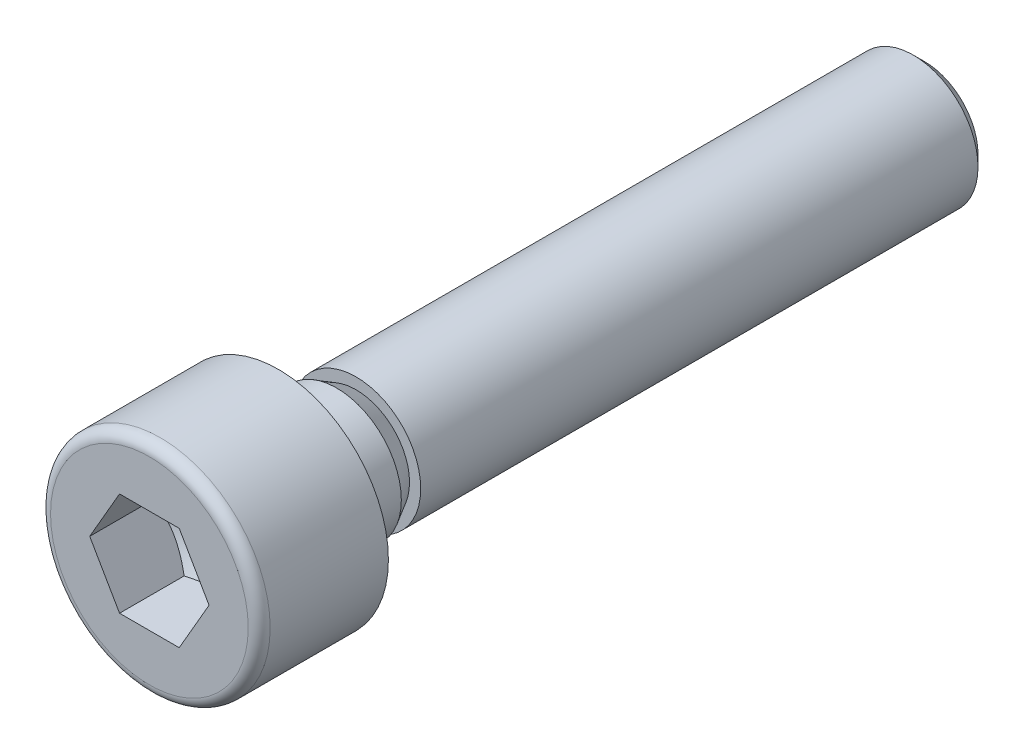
ISO-10303-21;
HEADER;
FILE_DESCRIPTION(('STEP AP214'),'2;1');
FILE_NAME('part.step','',(''),(''),'','','');
FILE_SCHEMA(('AUTOMOTIVE_DESIGN { 1 0 10303 214 1 1 1 1 }'));
ENDSEC;
DATA;
#1=APPLICATION_CONTEXT('core data for automotive mechanical design processes');
#2=APPLICATION_PROTOCOL_DEFINITION('international standard','automotive_design',2000,#1);
#3=PRODUCT_CONTEXT('',#1,'mechanical');
#4=PRODUCT('Part','Part','',(#3));
#5=PRODUCT_RELATED_PRODUCT_CATEGORY('part','',(#4));
#6=PRODUCT_DEFINITION_FORMATION('','',#4);
#7=PRODUCT_DEFINITION_CONTEXT('part definition',#1,'design');
#8=PRODUCT_DEFINITION('design','',#6,#7);
#9=PRODUCT_DEFINITION_SHAPE('','',#8);
#10=(LENGTH_UNIT() NAMED_UNIT(*) SI_UNIT(.MILLI.,.METRE.));
#11=(NAMED_UNIT(*) PLANE_ANGLE_UNIT() SI_UNIT($,.RADIAN.));
#12=(NAMED_UNIT(*) SI_UNIT($,.STERADIAN.) SOLID_ANGLE_UNIT());
#13=UNCERTAINTY_MEASURE_WITH_UNIT(LENGTH_MEASURE(1.E-05),#10,'distance_accuracy_value','');
#14=(GEOMETRIC_REPRESENTATION_CONTEXT(3) GLOBAL_UNCERTAINTY_ASSIGNED_CONTEXT((#13)) GLOBAL_UNIT_ASSIGNED_CONTEXT((#10,
#11,#12)) REPRESENTATION_CONTEXT('',''));
#15=CARTESIAN_POINT('',(0.,0.,0.));
#16=DIRECTION('',(0.,0.,1.));
#17=DIRECTION('',(1.,0.,0.));
#18=AXIS2_PLACEMENT_3D('',#15,#16,#17);
#19=CARTESIAN_POINT('',(0.,0.,5.));
#20=DIRECTION('',(0.,0.,1.));
#21=DIRECTION('',(1.,0.,0.));
#22=AXIS2_PLACEMENT_3D('',#19,#20,#21);
#23=PLANE('',#22);
#24=CARTESIAN_POINT('',(0.,0.,5.));
#25=DIRECTION('',(0.,0.,1.));
#26=DIRECTION('',(1.,0.,0.));
#27=AXIS2_PLACEMENT_3D('',#24,#25,#26);
#28=CIRCLE('',#27,3.825);
#29=CARTESIAN_POINT('',(3.825,0.,5.));
#30=VERTEX_POINT('',#29);
#31=EDGE_CURVE('E11',#30,#30,#28,.T.);
#32=ORIENTED_EDGE('',*,*,#31,.T.);
#33=EDGE_LOOP('',(#32));
#34=FACE_BOUND('',#33,.T.);
#35=DIRECTION('',(1.,0.,0.));
#36=VECTOR('',#35,1.);
#37=CARTESIAN_POINT('',(-1.1547,1.99999906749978,5.));
#38=LINE('',#37,#36);
#39=CARTESIAN_POINT('',(-1.1547,1.99999906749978,5.));
#40=VERTEX_POINT('',#39);
#41=CARTESIAN_POINT('',(1.1547,1.99999906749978,5.));
#42=VERTEX_POINT('',#41);
#43=EDGE_CURVE('E92',#40,#42,#38,.T.);
#44=ORIENTED_EDGE('',*,*,#43,.T.);
#45=DIRECTION('',(0.5,-0.866025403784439,0.));
#46=VECTOR('',#45,1.);
#47=CARTESIAN_POINT('',(1.1547,1.99999906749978,5.));
#48=LINE('',#47,#46);
#49=CARTESIAN_POINT('',(2.3094,0.,5.));
#50=VERTEX_POINT('',#49);
#51=EDGE_CURVE('E31',#42,#50,#48,.T.);
#52=ORIENTED_EDGE('',*,*,#51,.T.);
#53=DIRECTION('',(-0.5,-0.866025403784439,0.));
#54=VECTOR('',#53,1.);
#55=CARTESIAN_POINT('',(2.3094,0.,5.));
#56=LINE('',#55,#54);
#57=CARTESIAN_POINT('',(1.1547,-1.99999906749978,5.));
#58=VERTEX_POINT('',#57);
#59=EDGE_CURVE('E169',#50,#58,#56,.T.);
#60=ORIENTED_EDGE('',*,*,#59,.T.);
#61=DIRECTION('',(-1.,0.,0.));
#62=VECTOR('',#61,1.);
#63=CARTESIAN_POINT('',(1.1547,-1.99999906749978,5.));
#64=LINE('',#63,#62);
#65=CARTESIAN_POINT('',(-1.1547,-1.99999906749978,5.));
#66=VERTEX_POINT('',#65);
#67=EDGE_CURVE('E165',#58,#66,#64,.T.);
#68=ORIENTED_EDGE('',*,*,#67,.T.);
#69=DIRECTION('',(-0.5,0.866025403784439,0.));
#70=VECTOR('',#69,1.);
#71=CARTESIAN_POINT('',(-1.1547,-1.99999906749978,5.));
#72=LINE('',#71,#70);
#73=CARTESIAN_POINT('',(-2.3094,0.,5.));
#74=VERTEX_POINT('',#73);
#75=EDGE_CURVE('E160',#66,#74,#72,.T.);
#76=ORIENTED_EDGE('',*,*,#75,.T.);
#77=DIRECTION('',(0.5,0.866025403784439,0.));
#78=VECTOR('',#77,1.);
#79=CARTESIAN_POINT('',(-2.3094,0.,5.));
#80=LINE('',#79,#78);
#81=EDGE_CURVE('E96',#74,#40,#80,.T.);
#82=ORIENTED_EDGE('',*,*,#81,.T.);
#83=EDGE_LOOP('',(#44,#52,#60,#68,#76,#82));
#84=FACE_BOUND('',#83,.T.);
#85=ADVANCED_FACE('F17',(#34,#84),#23,.T.);
#86=CARTESIAN_POINT('',(0.,0.,4.575));
#87=DIRECTION('',(0.,0.,1.));
#88=DIRECTION('',(1.,0.,0.));
#89=AXIS2_PLACEMENT_3D('',#86,#87,#88);
#90=TOROIDAL_SURFACE('',#89,3.825,0.425);
#91=ORIENTED_EDGE('',*,*,#31,.F.);
#92=EDGE_LOOP('',(#91));
#93=FACE_BOUND('',#92,.T.);
#94=CARTESIAN_POINT('',(0.,0.,4.575));
#95=DIRECTION('',(0.,0.,1.));
#96=DIRECTION('',(1.,0.,0.));
#97=AXIS2_PLACEMENT_3D('',#94,#95,#96);
#98=CIRCLE('',#97,4.25);
#99=CARTESIAN_POINT('',(4.25,0.,4.575));
#100=VERTEX_POINT('',#99);
#101=EDGE_CURVE('E24',#100,#100,#98,.T.);
#102=ORIENTED_EDGE('',*,*,#101,.T.);
#103=EDGE_LOOP('',(#102));
#104=FACE_BOUND('',#103,.T.);
#105=ADVANCED_FACE('F133',(#93,#104),#90,.T.);
#106=CARTESIAN_POINT('',(0.,0.,5.));
#107=DIRECTION('',(0.,0.,1.));
#108=DIRECTION('',(1.,0.,0.));
#109=AXIS2_PLACEMENT_3D('',#106,#107,#108);
#110=CYLINDRICAL_SURFACE('',#109,4.25);
#111=CARTESIAN_POINT('',(0.,0.,0.));
#112=DIRECTION('',(0.,0.,1.));
#113=DIRECTION('',(1.,0.,0.));
#114=AXIS2_PLACEMENT_3D('',#111,#112,#113);
#115=CIRCLE('',#114,4.25);
#116=CARTESIAN_POINT('',(4.25,0.,0.));
#117=VERTEX_POINT('',#116);
#118=EDGE_CURVE('E128',#117,#117,#115,.T.);
#119=ORIENTED_EDGE('',*,*,#118,.T.);
#120=EDGE_LOOP('',(#119));
#121=FACE_BOUND('',#120,.T.);
#122=ORIENTED_EDGE('',*,*,#101,.F.);
#123=EDGE_LOOP('',(#122));
#124=FACE_BOUND('',#123,.T.);
#125=ADVANCED_FACE('F135',(#121,#124),#110,.T.);
#126=CARTESIAN_POINT('',(0.,4.25,0.));
#127=DIRECTION('',(0.,0.,-1.));
#128=DIRECTION('',(-1.,0.,0.));
#129=AXIS2_PLACEMENT_3D('',#126,#127,#128);
#130=PLANE('',#129);
#131=CARTESIAN_POINT('',(0.,0.,0.));
#132=DIRECTION('',(0.,0.,1.));
#133=DIRECTION('',(1.,0.,0.));
#134=AXIS2_PLACEMENT_3D('',#131,#132,#133);
#135=CIRCLE('',#134,2.75);
#136=CARTESIAN_POINT('',(2.75,0.,0.));
#137=VERTEX_POINT('',#136);
#138=EDGE_CURVE('E125',#137,#137,#135,.T.);
#139=ORIENTED_EDGE('',*,*,#138,.T.);
#140=EDGE_LOOP('',(#139));
#141=FACE_BOUND('',#140,.T.);
#142=ORIENTED_EDGE('',*,*,#118,.F.);
#143=EDGE_LOOP('',(#142));
#144=FACE_BOUND('',#143,.T.);
#145=ADVANCED_FACE('F137',(#141,#144),#130,.T.);
#146=CARTESIAN_POINT('',(0.,0.,-0.25));
#147=DIRECTION('',(0.,0.,1.));
#148=DIRECTION('',(1.,0.,0.));
#149=AXIS2_PLACEMENT_3D('',#146,#147,#148);
#150=TOROIDAL_SURFACE('',#149,2.75,0.25);
#151=CARTESIAN_POINT('',(0.,0.,-0.25));
#152=DIRECTION('',(0.,0.,1.));
#153=DIRECTION('',(1.,0.,0.));
#154=AXIS2_PLACEMENT_3D('',#151,#152,#153);
#155=CIRCLE('',#154,2.5);
#156=CARTESIAN_POINT('',(2.5,0.,-0.25));
#157=VERTEX_POINT('',#156);
#158=EDGE_CURVE('E122',#157,#157,#155,.T.);
#159=ORIENTED_EDGE('',*,*,#158,.T.);
#160=EDGE_LOOP('',(#159));
#161=FACE_BOUND('',#160,.T.);
#162=ORIENTED_EDGE('',*,*,#138,.F.);
#163=EDGE_LOOP('',(#162));
#164=FACE_BOUND('',#163,.T.);
#165=ADVANCED_FACE('F145',(#161,#164),#150,.F.);
#166=CARTESIAN_POINT('',(0.,0.,5.));
#167=DIRECTION('',(0.,0.,1.));
#168=DIRECTION('',(1.,0.,0.));
#169=AXIS2_PLACEMENT_3D('',#166,#167,#168);
#170=CYLINDRICAL_SURFACE('',#169,2.5);
#171=CARTESIAN_POINT('',(0.,0.,-2.25002200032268));
#172=DIRECTION('',(0.,0.,1.));
#173=DIRECTION('',(1.,0.,0.));
#174=AXIS2_PLACEMENT_3D('',#171,#172,#173);
#175=CIRCLE('',#174,2.5);
#176=CARTESIAN_POINT('',(2.5,0.,-2.25002200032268));
#177=VERTEX_POINT('',#176);
#178=EDGE_CURVE('E119',#177,#177,#175,.T.);
#179=ORIENTED_EDGE('',*,*,#178,.T.);
#180=EDGE_LOOP('',(#179));
#181=FACE_BOUND('',#180,.T.);
#182=ORIENTED_EDGE('',*,*,#158,.F.);
#183=EDGE_LOOP('',(#182));
#184=FACE_BOUND('',#183,.T.);
#185=ADVANCED_FACE('F343',(#181,#184),#170,.T.);
#186=CARTESIAN_POINT('',(0.,0.,-2.25002200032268));
#187=DIRECTION('',(0.,0.,1.));
#188=DIRECTION('',(1.,0.,0.));
#189=AXIS2_PLACEMENT_3D('',#186,#187,#188);
#190=CONICAL_SURFACE('',#189,2.5,0.523598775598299);
#191=CARTESIAN_POINT('',(0.,0.,-3.));
#192=DIRECTION('',(0.,0.,1.));
#193=DIRECTION('',(1.,0.,0.));
#194=AXIS2_PLACEMENT_3D('',#191,#192,#193);
#195=CIRCLE('',#194,2.067);
#196=CARTESIAN_POINT('',(2.067,0.,-3.));
#197=VERTEX_POINT('',#196);
#198=EDGE_CURVE('E116',#197,#197,#195,.T.);
#199=ORIENTED_EDGE('',*,*,#198,.T.);
#200=EDGE_LOOP('',(#199));
#201=FACE_BOUND('',#200,.T.);
#202=ORIENTED_EDGE('',*,*,#178,.F.);
#203=EDGE_LOOP('',(#202));
#204=FACE_BOUND('',#203,.T.);
#205=ADVANCED_FACE('F332',(#201,#204),#190,.T.);
#206=CARTESIAN_POINT('',(0.,2.067,-3.));
#207=DIRECTION('',(0.,0.,1.));
#208=DIRECTION('',(1.,0.,0.));
#209=AXIS2_PLACEMENT_3D('',#206,#207,#208);
#210=PLANE('',#209);
#211=CARTESIAN_POINT('',(0.,0.,-3.));
#212=DIRECTION('',(0.,0.,1.));
#213=DIRECTION('',(1.,0.,0.));
#214=AXIS2_PLACEMENT_3D('',#211,#212,#213);
#215=CIRCLE('',#214,2.5);
#216=CARTESIAN_POINT('',(2.5,0.,-3.));
#217=VERTEX_POINT('',#216);
#218=EDGE_CURVE('E113',#217,#217,#215,.T.);
#219=ORIENTED_EDGE('',*,*,#218,.T.);
#220=EDGE_LOOP('',(#219));
#221=FACE_BOUND('',#220,.T.);
#222=ORIENTED_EDGE('',*,*,#198,.F.);
#223=EDGE_LOOP('',(#222));
#224=FACE_BOUND('',#223,.T.);
#225=ADVANCED_FACE('F321',(#221,#224),#210,.T.);
#226=CARTESIAN_POINT('',(0.,0.,5.));
#227=DIRECTION('',(0.,0.,1.));
#228=DIRECTION('',(1.,0.,0.));
#229=AXIS2_PLACEMENT_3D('',#226,#227,#228);
#230=CYLINDRICAL_SURFACE('',#229,2.5);
#231=CARTESIAN_POINT('',(0.,0.,-24.567));
#232=DIRECTION('',(0.,0.,1.));
#233=DIRECTION('',(1.,0.,0.));
#234=AXIS2_PLACEMENT_3D('',#231,#232,#233);
#235=CIRCLE('',#234,2.5);
#236=CARTESIAN_POINT('',(2.5,0.,-24.567));
#237=VERTEX_POINT('',#236);
#238=EDGE_CURVE('E110',#237,#237,#235,.T.);
#239=ORIENTED_EDGE('',*,*,#238,.T.);
#240=EDGE_LOOP('',(#239));
#241=FACE_BOUND('',#240,.T.);
#242=ORIENTED_EDGE('',*,*,#218,.F.);
#243=EDGE_LOOP('',(#242));
#244=FACE_BOUND('',#243,.T.);
#245=ADVANCED_FACE('F310',(#241,#244),#230,.T.);
#246=CARTESIAN_POINT('',(0.,0.,-24.567));
#247=DIRECTION('',(0.,0.,1.));
#248=DIRECTION('',(1.,0.,0.));
#249=AXIS2_PLACEMENT_3D('',#246,#247,#248);
#250=CONICAL_SURFACE('',#249,2.5,0.785398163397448);
#251=CARTESIAN_POINT('',(0.,0.,-25.));
#252=DIRECTION('',(0.,0.,1.));
#253=DIRECTION('',(1.,0.,0.));
#254=AXIS2_PLACEMENT_3D('',#251,#252,#253);
#255=CIRCLE('',#254,2.067);
#256=CARTESIAN_POINT('',(2.067,0.,-25.));
#257=VERTEX_POINT('',#256);
#258=EDGE_CURVE('E107',#257,#257,#255,.T.);
#259=ORIENTED_EDGE('',*,*,#258,.T.);
#260=EDGE_LOOP('',(#259));
#261=FACE_BOUND('',#260,.T.);
#262=ORIENTED_EDGE('',*,*,#238,.F.);
#263=EDGE_LOOP('',(#262));
#264=FACE_BOUND('',#263,.T.);
#265=ADVANCED_FACE('F300',(#261,#264),#250,.T.);
#266=CARTESIAN_POINT('',(0.,2.067,-25.));
#267=DIRECTION('',(0.,0.,-1.));
#268=DIRECTION('',(-1.,0.,0.));
#269=AXIS2_PLACEMENT_3D('',#266,#267,#268);
#270=PLANE('',#269);
#271=ORIENTED_EDGE('',*,*,#258,.F.);
#272=EDGE_LOOP('',(#271));
#273=FACE_BOUND('',#272,.T.);
#274=ADVANCED_FACE('F225',(#273),#270,.T.);
#275=CARTESIAN_POINT('',(1.1547,1.99999906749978,1.16666728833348));
#276=DIRECTION('',(-0.866025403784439,-0.5,0.));
#277=DIRECTION('',(-0.5,0.866025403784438,0.));
#278=AXIS2_PLACEMENT_3D('',#275,#276,#277);
#279=PLANE('',#278);
#280=DIRECTION('',(0.,0.,1.));
#281=VECTOR('',#280,1.);
#282=CARTESIAN_POINT('',(2.3094,0.,1.16666728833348));
#283=LINE('',#282,#281);
#284=CARTESIAN_POINT('',(2.3094,0.,2.5));
#285=VERTEX_POINT('',#284);
#286=EDGE_CURVE('E105',#285,#50,#283,.T.);
#287=ORIENTED_EDGE('',*,*,#286,.T.);
#288=ORIENTED_EDGE('',*,*,#51,.F.);
#289=DIRECTION('',(0.,0.,1.));
#290=VECTOR('',#289,1.);
#291=CARTESIAN_POINT('',(1.1547,1.99999906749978,1.16666728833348));
#292=LINE('',#291,#290);
#293=CARTESIAN_POINT('',(1.1547,1.99999906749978,2.5));
#294=VERTEX_POINT('',#293);
#295=EDGE_CURVE('E86',#294,#42,#292,.T.);
#296=ORIENTED_EDGE('',*,*,#295,.F.);
#297=CARTESIAN_POINT('',(2.30940011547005,-2.00000000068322E-07,2.50000006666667));
#298=CARTESIAN_POINT('',(2.25865804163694,0.0878876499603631,2.47069561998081));
#299=CARTESIAN_POINT('',(2.20747796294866,0.176534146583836,2.44404475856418));
#300=CARTESIAN_POINT('',(2.10423165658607,0.355361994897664,2.39752647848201));
#301=CARTESIAN_POINT('',(2.0521635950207,0.445546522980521,2.37767551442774));
#302=CARTESIAN_POINT('',(1.94867272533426,0.624797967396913,2.34677605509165));
#303=CARTESIAN_POINT('',(1.89726583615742,0.713837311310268,2.33552188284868));
#304=CARTESIAN_POINT('',(1.79421029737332,0.892334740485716,2.32208925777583));
#305=CARTESIAN_POINT('',(1.74256202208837,0.981792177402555,2.31989967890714));
#306=CARTESIAN_POINT('',(1.64606274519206,1.14893382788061,2.32446636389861));
#307=CARTESIAN_POINT('',(1.60119726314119,1.2266431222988,2.33010135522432));
#308=CARTESIAN_POINT('',(1.51175858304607,1.38155546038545,2.34795736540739));
#309=CARTESIAN_POINT('',(1.46718569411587,1.45875796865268,2.36018447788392));
#310=CARTESIAN_POINT('',(1.37756276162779,1.61398944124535,2.39074989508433));
#311=CARTESIAN_POINT('',(1.3325240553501,1.69199876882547,2.40921770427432));
#312=CARTESIAN_POINT('',(1.2431182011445,1.84685425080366,2.45113182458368));
#313=CARTESIAN_POINT('',(1.19874990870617,1.92370238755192,2.47456829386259));
#314=CARTESIAN_POINT('',(1.15469988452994,1.99999926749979,2.50000006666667));
#315=B_SPLINE_CURVE_WITH_KNOTS('',3,(#297,#298,#299,#300,#301,#302,#303,#304,#305,#306,#307,
#308,#309,#310,#311,#312,#313,#314),.UNSPECIFIED.,.F.,.F.,(4,2,2,2,2,2,2,2,4),(0.,
0.317015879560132,0.634793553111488,0.944707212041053,1.25424036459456,1.52370723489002,
1.79342362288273,2.06912103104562,2.3442773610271),.UNSPECIFIED.);
#316=EDGE_CURVE('E79',#285,#294,#315,.T.);
#317=ORIENTED_EDGE('',*,*,#316,.F.);
#318=EDGE_LOOP('',(#287,#288,#296,#317));
#319=FACE_BOUND('',#318,.T.);
#320=ADVANCED_FACE('F87',(#319),#279,.T.);
#321=CARTESIAN_POINT('',(2.3094,0.,1.16666728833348));
#322=DIRECTION('',(-0.866025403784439,0.5,0.));
#323=DIRECTION('',(0.5,0.866025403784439,0.));
#324=AXIS2_PLACEMENT_3D('',#321,#322,#323);
#325=PLANE('',#324);
#326=DIRECTION('',(0.,0.,1.));
#327=VECTOR('',#326,1.);
#328=CARTESIAN_POINT('',(1.1547,-1.99999906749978,1.16666728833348));
#329=LINE('',#328,#327);
#330=CARTESIAN_POINT('',(1.1547,-1.99999906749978,2.5));
#331=VERTEX_POINT('',#330);
#332=EDGE_CURVE('E103',#331,#58,#329,.T.);
#333=ORIENTED_EDGE('',*,*,#332,.T.);
#334=ORIENTED_EDGE('',*,*,#59,.F.);
#335=ORIENTED_EDGE('',*,*,#286,.F.);
#336=CARTESIAN_POINT('',(1.15469988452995,-1.99999926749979,2.50000006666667));
#337=CARTESIAN_POINT('',(1.20544195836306,-1.91211141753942,2.47069561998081));
#338=CARTESIAN_POINT('',(1.25662203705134,-1.82346492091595,2.44404475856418));
#339=CARTESIAN_POINT('',(1.35986834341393,-1.64463707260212,2.39752647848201));
#340=CARTESIAN_POINT('',(1.41193640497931,-1.55445254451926,2.37767551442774));
#341=CARTESIAN_POINT('',(1.51542727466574,-1.37520110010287,2.34677605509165));
#342=CARTESIAN_POINT('',(1.56683416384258,-1.28616175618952,2.33552188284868));
#343=CARTESIAN_POINT('',(1.66988970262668,-1.10766432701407,2.32208925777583));
#344=CARTESIAN_POINT('',(1.72153797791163,-1.01820689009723,2.31989967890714));
#345=CARTESIAN_POINT('',(1.81803725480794,-0.851065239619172,2.32446636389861));
#346=CARTESIAN_POINT('',(1.86290273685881,-0.773355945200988,2.33010135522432));
#347=CARTESIAN_POINT('',(1.95234141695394,-0.618443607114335,2.34795736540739));
#348=CARTESIAN_POINT('',(1.99691430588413,-0.541241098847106,2.36018447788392));
#349=CARTESIAN_POINT('',(2.08653723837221,-0.386009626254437,2.39074989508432));
#350=CARTESIAN_POINT('',(2.1315759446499,-0.308000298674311,2.40921770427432));
#351=CARTESIAN_POINT('',(2.2209817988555,-0.153144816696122,2.45113182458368));
#352=CARTESIAN_POINT('',(2.26535009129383,-0.0762966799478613,2.47456829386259));
#353=CARTESIAN_POINT('',(2.30940011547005,1.99999999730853E-07,2.50000006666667));
#354=B_SPLINE_CURVE_WITH_KNOTS('',3,(#336,#337,#338,#339,#340,#341,#342,#343,#344,#345,#346,
#347,#348,#349,#350,#351,#352,#353),.UNSPECIFIED.,.F.,.F.,(4,2,2,2,2,2,2,2,4),(0.,
0.317015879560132,0.63479355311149,0.944707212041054,1.25424036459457,1.52370723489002,
1.79342362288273,2.06912103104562,2.3442773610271),.UNSPECIFIED.);
#355=EDGE_CURVE('E83',#331,#285,#354,.T.);
#356=ORIENTED_EDGE('',*,*,#355,.F.);
#357=EDGE_LOOP('',(#333,#334,#335,#356));
#358=FACE_BOUND('',#357,.T.);
#359=ADVANCED_FACE('F216',(#358),#325,.T.);
#360=CARTESIAN_POINT('',(1.1547,-1.99999906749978,1.16666728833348));
#361=DIRECTION('',(0.,1.,0.));
#362=DIRECTION('',(1.,0.,0.));
#363=AXIS2_PLACEMENT_3D('',#360,#361,#362);
#364=PLANE('',#363);
#365=DIRECTION('',(0.,0.,1.));
#366=VECTOR('',#365,1.);
#367=CARTESIAN_POINT('',(-1.1547,-1.99999906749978,1.16666728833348));
#368=LINE('',#367,#366);
#369=CARTESIAN_POINT('',(-1.1547,-1.99999906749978,2.5));
#370=VERTEX_POINT('',#369);
#371=EDGE_CURVE('E101',#370,#66,#368,.T.);
#372=ORIENTED_EDGE('',*,*,#371,.T.);
#373=ORIENTED_EDGE('',*,*,#67,.F.);
#374=ORIENTED_EDGE('',*,*,#332,.F.);
#375=CARTESIAN_POINT('',(-2.99028884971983,-1.99999906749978,3.24367023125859));
#376=CARTESIAN_POINT('',(-2.90317192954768,-1.99999906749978,3.20187519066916));
#377=CARTESIAN_POINT('',(-2.81584104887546,-1.99999906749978,3.16051761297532));
#378=CARTESIAN_POINT('',(-2.64063562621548,-1.99999906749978,3.0789285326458));
#379=CARTESIAN_POINT('',(-2.55276098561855,-1.99999906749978,3.03869724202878));
#380=CARTESIAN_POINT('',(-2.3758459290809,-1.99999906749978,2.95938612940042));
#381=CARTESIAN_POINT('',(-2.28680167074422,-1.99999906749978,2.92031484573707));
#382=CARTESIAN_POINT('',(-2.10795626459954,-1.99999906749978,2.8439516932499));
#383=CARTESIAN_POINT('',(-2.01815515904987,-1.99999906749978,2.80665972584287));
#384=CARTESIAN_POINT('',(-1.83686369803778,-1.99999906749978,2.73401825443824));
#385=CARTESIAN_POINT('',(-1.74536545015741,-1.99999906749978,2.69868833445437));
#386=CARTESIAN_POINT('',(-1.56126782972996,-1.99999906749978,2.63096669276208));
#387=CARTESIAN_POINT('',(-1.46866833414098,-1.99999906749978,2.59857530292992));
#388=CARTESIAN_POINT('',(-1.28243840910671,-1.99999906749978,2.53764905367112));
#389=CARTESIAN_POINT('',(-1.18881093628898,-1.99999906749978,2.50910525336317));
#390=CARTESIAN_POINT('',(-1.00022528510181,-1.99999906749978,2.4568366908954));
#391=CARTESIAN_POINT('',(-0.905267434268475,-1.99999906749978,2.4331107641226));
#392=CARTESIAN_POINT('',(-0.71371686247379,-1.99999906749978,2.39161533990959));
#393=CARTESIAN_POINT('',(-0.617119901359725,-1.99999906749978,2.37386503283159));
#394=CARTESIAN_POINT('',(-0.422840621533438,-1.99999906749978,2.3456452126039));
#395=CARTESIAN_POINT('',(-0.325158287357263,-1.99999906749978,2.33517580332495));
#396=CARTESIAN_POINT('',(-0.129781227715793,-1.99999906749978,2.32244752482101));
#397=CARTESIAN_POINT('',(-0.0320894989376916,-1.99999906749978,2.32014401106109));
#398=CARTESIAN_POINT('',(0.163106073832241,-1.99999906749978,2.32382903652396));
#399=CARTESIAN_POINT('',(0.260609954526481,-1.99999906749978,2.32981574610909));
#400=CARTESIAN_POINT('',(0.500844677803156,-1.99999906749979,2.35424764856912));
#401=CARTESIAN_POINT('',(0.643111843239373,-1.99999906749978,2.37725229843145));
#402=CARTESIAN_POINT('',(0.925045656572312,-1.99999906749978,2.43661328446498));
#403=CARTESIAN_POINT('',(1.06470522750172,-1.99999906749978,2.47300159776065));
#404=CARTESIAN_POINT('',(1.27351689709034,-1.99999906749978,2.53514594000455));
#405=CARTESIAN_POINT('',(1.34375129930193,-1.99999906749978,2.5573998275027));
#406=CARTESIAN_POINT('',(1.48353794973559,-1.99999906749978,2.60398175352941));
#407=CARTESIAN_POINT('',(1.55309013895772,-1.99999906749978,2.62830996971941));
#408=CARTESIAN_POINT('',(1.691168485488,-1.99999906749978,2.67852978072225));
#409=CARTESIAN_POINT('',(1.75969824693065,-1.99999906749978,2.70441154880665));
#410=CARTESIAN_POINT('',(1.89618572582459,-1.99999906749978,2.7575794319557));
#411=CARTESIAN_POINT('',(1.96414362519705,-1.99999906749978,2.78486507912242));
#412=CARTESIAN_POINT('',(2.03186196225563,-1.99999906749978,2.81271905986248));
#413=B_SPLINE_CURVE_WITH_KNOTS('',3,(#375,#376,#377,#378,#379,#380,#381,#382,#383,#384,#385,
#386,#387,#388,#389,#390,#391,#392,#393,#394,#395,#396,#397,#398,#399,#400,#401,#402,#403,#404,
#405,#406,#407,#408,#409,#410,#411,#412),.UNSPECIFIED.,.F.,.F.,(4,2,2,2,2,2,2,2,2,2,2,2,2,2,2,2,
2,2,4),(0.,0.289876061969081,0.579806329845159,0.871508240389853,1.16319397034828,
1.45740181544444,1.75164284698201,2.04518789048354,2.33866189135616,2.63306957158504,
2.92748145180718,3.22028122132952,3.513016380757,3.94447373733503,4.37696872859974,
4.59797161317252,4.81899344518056,5.03874045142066,5.25841468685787),.UNSPECIFIED.);
#414=EDGE_CURVE('E207',#370,#331,#413,.T.);
#415=ORIENTED_EDGE('',*,*,#414,.F.);
#416=EDGE_LOOP('',(#372,#373,#374,#415));
#417=FACE_BOUND('',#416,.T.);
#418=ADVANCED_FACE('F212',(#417),#364,.T.);
#419=CARTESIAN_POINT('',(-1.1547,-1.99999906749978,1.16666728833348));
#420=DIRECTION('',(0.866025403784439,0.5,0.));
#421=DIRECTION('',(0.5,-0.866025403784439,0.));
#422=AXIS2_PLACEMENT_3D('',#419,#420,#421);
#423=PLANE('',#422);
#424=DIRECTION('',(0.,0.,1.));
#425=VECTOR('',#424,1.);
#426=CARTESIAN_POINT('',(-2.3094,0.,1.16666728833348));
#427=LINE('',#426,#425);
#428=CARTESIAN_POINT('',(-2.3094,0.,2.5));
#429=VERTEX_POINT('',#428);
#430=EDGE_CURVE('E94',#429,#74,#427,.T.);
#431=ORIENTED_EDGE('',*,*,#430,.T.);
#432=ORIENTED_EDGE('',*,*,#75,.F.);
#433=ORIENTED_EDGE('',*,*,#371,.F.);
#434=CARTESIAN_POINT('',(-2.30940011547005,2.00000000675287E-07,2.50000006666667));
#435=CARTESIAN_POINT('',(-2.25865804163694,-0.087887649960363,2.47069561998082));
#436=CARTESIAN_POINT('',(-2.20747796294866,-0.176534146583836,2.44404475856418));
#437=CARTESIAN_POINT('',(-2.10423165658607,-0.355361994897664,2.39752647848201));
#438=CARTESIAN_POINT('',(-2.0521635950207,-0.445546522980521,2.37767551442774));
#439=CARTESIAN_POINT('',(-1.94867272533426,-0.624797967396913,2.34677605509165));
#440=CARTESIAN_POINT('',(-1.89726583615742,-0.713837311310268,2.33552188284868));
#441=CARTESIAN_POINT('',(-1.79421029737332,-0.892334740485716,2.32208925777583));
#442=CARTESIAN_POINT('',(-1.74256202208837,-0.981792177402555,2.31989967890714));
#443=CARTESIAN_POINT('',(-1.64606274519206,-1.14893382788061,2.32446636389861));
#444=CARTESIAN_POINT('',(-1.60119726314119,-1.22664312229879,2.33010135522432));
#445=CARTESIAN_POINT('',(-1.51175858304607,-1.38155546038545,2.34795736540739));
#446=CARTESIAN_POINT('',(-1.46718569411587,-1.45875796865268,2.36018447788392));
#447=CARTESIAN_POINT('',(-1.37756276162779,-1.61398944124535,2.39074989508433));
#448=CARTESIAN_POINT('',(-1.3325240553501,-1.69199876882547,2.40921770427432));
#449=CARTESIAN_POINT('',(-1.2431182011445,-1.84685425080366,2.45113182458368));
#450=CARTESIAN_POINT('',(-1.19874990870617,-1.92370238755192,2.47456829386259));
#451=CARTESIAN_POINT('',(-1.15469988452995,-1.99999926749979,2.50000006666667));
#452=B_SPLINE_CURVE_WITH_KNOTS('',3,(#434,#435,#436,#437,#438,#439,#440,#441,#442,#443,#444,
#445,#446,#447,#448,#449,#450,#451),.UNSPECIFIED.,.F.,.F.,(4,2,2,2,2,2,2,2,4),(0.,
0.317015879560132,0.634793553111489,0.944707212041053,1.25424036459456,1.52370723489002,
1.79342362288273,2.06912103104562,2.3442773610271),.UNSPECIFIED.);
#453=EDGE_CURVE('E202',#429,#370,#452,.T.);
#454=ORIENTED_EDGE('',*,*,#453,.F.);
#455=EDGE_LOOP('',(#431,#432,#433,#454));
#456=FACE_BOUND('',#455,.T.);
#457=ADVANCED_FACE('F215',(#456),#423,.T.);
#458=CARTESIAN_POINT('',(-2.3094,0.,1.16666728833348));
#459=DIRECTION('',(0.866025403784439,-0.5,0.));
#460=DIRECTION('',(-0.5,-0.866025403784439,0.));
#461=AXIS2_PLACEMENT_3D('',#458,#459,#460);
#462=PLANE('',#461);
#463=DIRECTION('',(0.,0.,1.));
#464=VECTOR('',#463,1.);
#465=CARTESIAN_POINT('',(-1.1547,1.99999906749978,1.16666728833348));
#466=LINE('',#465,#464);
#467=CARTESIAN_POINT('',(-1.1547,1.99999906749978,2.5));
#468=VERTEX_POINT('',#467);
#469=EDGE_CURVE('E91',#468,#40,#466,.T.);
#470=ORIENTED_EDGE('',*,*,#469,.T.);
#471=ORIENTED_EDGE('',*,*,#81,.F.);
#472=ORIENTED_EDGE('',*,*,#430,.F.);
#473=CARTESIAN_POINT('',(-1.15469988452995,1.99999926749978,2.50000006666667));
#474=CARTESIAN_POINT('',(-1.20544195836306,1.91211141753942,2.47069561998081));
#475=CARTESIAN_POINT('',(-1.25662203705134,1.82346492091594,2.44404475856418));
#476=CARTESIAN_POINT('',(-1.35986834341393,1.64463707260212,2.39752647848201));
#477=CARTESIAN_POINT('',(-1.41193640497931,1.55445254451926,2.37767551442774));
#478=CARTESIAN_POINT('',(-1.51542727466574,1.37520110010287,2.34677605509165));
#479=CARTESIAN_POINT('',(-1.56683416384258,1.28616175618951,2.33552188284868));
#480=CARTESIAN_POINT('',(-1.66988970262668,1.10766432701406,2.32208925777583));
#481=CARTESIAN_POINT('',(-1.72153797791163,1.01820689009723,2.31989967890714));
#482=CARTESIAN_POINT('',(-1.81803725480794,0.851065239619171,2.32446636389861));
#483=CARTESIAN_POINT('',(-1.86290273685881,0.773355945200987,2.33010135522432));
#484=CARTESIAN_POINT('',(-1.95234141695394,0.618443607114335,2.34795736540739));
#485=CARTESIAN_POINT('',(-1.99691430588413,0.541241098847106,2.36018447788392));
#486=CARTESIAN_POINT('',(-2.08653723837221,0.386009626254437,2.39074989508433));
#487=CARTESIAN_POINT('',(-2.1315759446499,0.308000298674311,2.40921770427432));
#488=CARTESIAN_POINT('',(-2.2209817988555,0.153144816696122,2.45113182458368));
#489=CARTESIAN_POINT('',(-2.26535009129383,0.0762966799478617,2.47456829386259));
#490=CARTESIAN_POINT('',(-2.30940011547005,-1.99999999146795E-07,2.50000006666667));
#491=B_SPLINE_CURVE_WITH_KNOTS('',3,(#473,#474,#475,#476,#477,#478,#479,#480,#481,#482,#483,
#484,#485,#486,#487,#488,#489,#490),.UNSPECIFIED.,.F.,.F.,(4,2,2,2,2,2,2,2,4),(0.,
0.317015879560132,0.634793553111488,0.944707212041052,1.25424036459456,1.52370723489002,
1.79342362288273,2.06912103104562,2.34427736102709),.UNSPECIFIED.);
#492=EDGE_CURVE('E39',#468,#429,#491,.T.);
#493=ORIENTED_EDGE('',*,*,#492,.F.);
#494=EDGE_LOOP('',(#470,#471,#472,#493));
#495=FACE_BOUND('',#494,.T.);
#496=ADVANCED_FACE('F159',(#495),#462,.T.);
#497=CARTESIAN_POINT('',(-1.1547,1.99999906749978,1.16666728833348));
#498=DIRECTION('',(0.,-1.,0.));
#499=DIRECTION('',(-1.,0.,0.));
#500=AXIS2_PLACEMENT_3D('',#497,#498,#499);
#501=PLANE('',#500);
#502=ORIENTED_EDGE('',*,*,#295,.T.);
#503=ORIENTED_EDGE('',*,*,#43,.F.);
#504=ORIENTED_EDGE('',*,*,#469,.F.);
#505=CARTESIAN_POINT('',(-2.99028884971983,1.99999906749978,3.24367023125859));
#506=CARTESIAN_POINT('',(-2.90317192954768,1.99999906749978,3.20187519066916));
#507=CARTESIAN_POINT('',(-2.81584104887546,1.99999906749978,3.16051761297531));
#508=CARTESIAN_POINT('',(-2.64063562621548,1.99999906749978,3.0789285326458));
#509=CARTESIAN_POINT('',(-2.55276098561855,1.99999906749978,3.03869724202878));
#510=CARTESIAN_POINT('',(-2.3758459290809,1.99999906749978,2.95938612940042));
#511=CARTESIAN_POINT('',(-2.28680167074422,1.99999906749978,2.92031484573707));
#512=CARTESIAN_POINT('',(-2.10795626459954,1.99999906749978,2.8439516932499));
#513=CARTESIAN_POINT('',(-2.01815515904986,1.99999906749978,2.80665972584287));
#514=CARTESIAN_POINT('',(-1.83686369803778,1.99999906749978,2.73401825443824));
#515=CARTESIAN_POINT('',(-1.74536545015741,1.99999906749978,2.69868833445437));
#516=CARTESIAN_POINT('',(-1.56126782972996,1.99999906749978,2.63096669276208));
#517=CARTESIAN_POINT('',(-1.46866833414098,1.99999906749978,2.59857530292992));
#518=CARTESIAN_POINT('',(-1.28243840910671,1.99999906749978,2.53764905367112));
#519=CARTESIAN_POINT('',(-1.18881093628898,1.99999906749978,2.50910525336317));
#520=CARTESIAN_POINT('',(-1.00022528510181,1.99999906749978,2.45683669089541));
#521=CARTESIAN_POINT('',(-0.905267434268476,1.99999906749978,2.4331107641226));
#522=CARTESIAN_POINT('',(-0.713716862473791,1.99999906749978,2.39161533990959));
#523=CARTESIAN_POINT('',(-0.617119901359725,1.99999906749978,2.37386503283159));
#524=CARTESIAN_POINT('',(-0.422840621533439,1.99999906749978,2.3456452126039));
#525=CARTESIAN_POINT('',(-0.325158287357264,1.99999906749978,2.33517580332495));
#526=CARTESIAN_POINT('',(-0.129781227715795,1.99999906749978,2.32244752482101));
#527=CARTESIAN_POINT('',(-0.032089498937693,1.99999906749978,2.32014401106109));
#528=CARTESIAN_POINT('',(0.16310607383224,1.99999906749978,2.32382903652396));
#529=CARTESIAN_POINT('',(0.26060995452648,1.99999906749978,2.32981574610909));
#530=CARTESIAN_POINT('',(0.500844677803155,1.99999906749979,2.35424764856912));
#531=CARTESIAN_POINT('',(0.643111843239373,1.99999906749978,2.37725229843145));
#532=CARTESIAN_POINT('',(0.925045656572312,1.99999906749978,2.43661328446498));
#533=CARTESIAN_POINT('',(1.06470522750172,1.99999906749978,2.47300159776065));
#534=CARTESIAN_POINT('',(1.27351689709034,1.99999906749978,2.53514594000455));
#535=CARTESIAN_POINT('',(1.34375129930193,1.99999906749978,2.5573998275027));
#536=CARTESIAN_POINT('',(1.4835379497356,1.99999906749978,2.60398175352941));
#537=CARTESIAN_POINT('',(1.55309013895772,1.99999906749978,2.62830996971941));
#538=CARTESIAN_POINT('',(1.691168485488,1.99999906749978,2.67852978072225));
#539=CARTESIAN_POINT('',(1.75969824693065,1.99999906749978,2.70441154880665));
#540=CARTESIAN_POINT('',(1.89618572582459,1.99999906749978,2.7575794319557));
#541=CARTESIAN_POINT('',(1.96414362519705,1.99999906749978,2.78486507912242));
#542=CARTESIAN_POINT('',(2.03186196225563,1.99999906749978,2.81271905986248));
#543=B_SPLINE_CURVE_WITH_KNOTS('',3,(#505,#506,#507,#508,#509,#510,#511,#512,#513,#514,#515,
#516,#517,#518,#519,#520,#521,#522,#523,#524,#525,#526,#527,#528,#529,#530,#531,#532,#533,#534,
#535,#536,#537,#538,#539,#540,#541,#542),.UNSPECIFIED.,.F.,.F.,(4,2,2,2,2,2,2,2,2,2,2,2,2,2,2,2,
2,2,4),(0.,0.289876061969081,0.579806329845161,0.871508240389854,1.16319397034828,
1.45740181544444,1.75164284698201,2.04518789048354,2.33866189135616,2.63306957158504,
2.92748145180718,3.22028122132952,3.513016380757,3.94447373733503,4.37696872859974,
4.59797161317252,4.81899344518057,5.03874045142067,5.25841468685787),.UNSPECIFIED.);
#544=EDGE_CURVE('E80',#294,#468,#543,.F.);
#545=ORIENTED_EDGE('',*,*,#544,.F.);
#546=EDGE_LOOP('',(#502,#503,#504,#545));
#547=FACE_BOUND('',#546,.T.);
#548=ADVANCED_FACE('F75',(#547),#501,.T.);
#549=CARTESIAN_POINT('',(0.,0.,1.16666728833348));
#550=DIRECTION('',(0.,0.,1.));
#551=DIRECTION('',(1.,0.,0.));
#552=AXIS2_PLACEMENT_3D('',#549,#550,#551);
#553=CONICAL_SURFACE('',#552,0.,1.0471975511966);
#554=CARTESIAN_POINT('',(0.,0.,1.16666728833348));
#555=VERTEX_POINT('',#554);
#556=VERTEX_LOOP('',#555);
#557=FACE_BOUND('',#556,.T.);
#558=ORIENTED_EDGE('',*,*,#316,.T.);
#559=ORIENTED_EDGE('',*,*,#544,.T.);
#560=ORIENTED_EDGE('',*,*,#492,.T.);
#561=ORIENTED_EDGE('',*,*,#453,.T.);
#562=ORIENTED_EDGE('',*,*,#414,.T.);
#563=ORIENTED_EDGE('',*,*,#355,.T.);
#564=EDGE_LOOP('',(#558,#559,#560,#561,#562,#563));
#565=FACE_BOUND('',#564,.T.);
#566=ADVANCED_FACE('F72',(#557,#565),#553,.F.);
#567=CLOSED_SHELL('',(#85,#105,#125,#145,#165,#185,#205,#225,#245,#265,#274,#320,#359,#418,#457,
#496,#548,#566));
#568=MANIFOLD_SOLID_BREP('B1',#567);
#569=ADVANCED_BREP_SHAPE_REPRESENTATION('',(#18,#568),#14);
#570=SHAPE_DEFINITION_REPRESENTATION(#9,#569);
ENDSEC;
END-ISO-10303-21;
